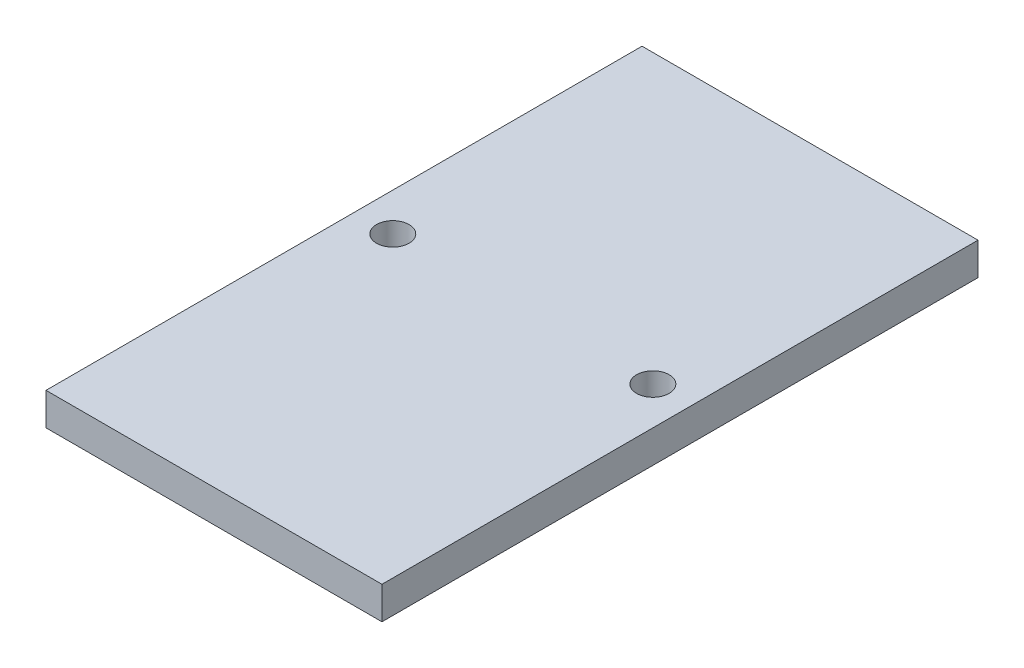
from build123d import *

# Parameters (mm, degrees)
SKETCH1_W      = 62
SKETCH1_H      = 110
SKETCH1_R      = 3
EXTRUDE1_DEPTH = 6


with BuildPart() as part:
    # Sketch1 → Extrude1 (new body)
    with BuildSketch(Plane(origin=(0, 0, 0), x_dir=(1, 0, 0), z_dir=(0, 1, 0))):
        with Locations((31, 55)):
            Rectangle(SKETCH1_W, SKETCH1_H)
        with Locations(Location((7, 57, 0), (0, 0, 270))):
            Circle(SKETCH1_R, mode=Mode.SUBTRACT)
        with Locations(Location((55, 57, 0), (0, 0, 270))):
            Circle(SKETCH1_R, mode=Mode.SUBTRACT)
    extrude(amount=EXTRUDE1_DEPTH)


solid = part.part
